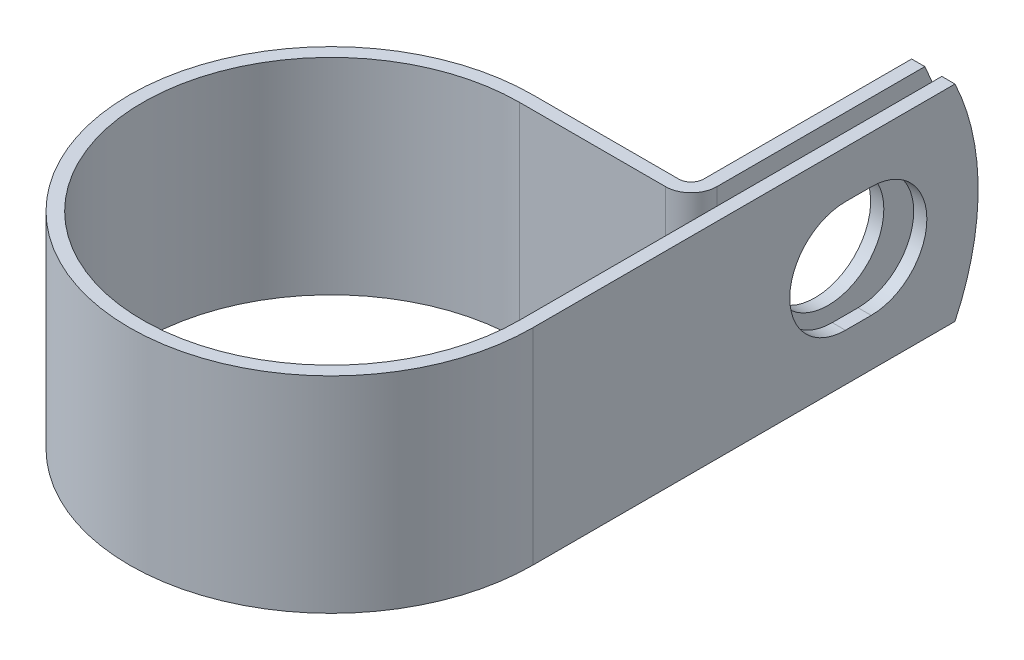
from build123d import *

# Parameters (mm, degrees)
EXTRUDE_THIN1_DEPTH = 9.525
SKETCH2_R           = 5.1562
CUT_EXTRUDE1_DEPTH  = 1.2192
CUT_EXTRUDE2_REACH  = 58.465
CUT_EXTRUDE3_DEPTH  = 54.893329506


with BuildPart() as part:
    # Sketch1 → Extrude-Thin1 (new, symmetric)
    with BuildSketch(Plane(origin=(0, 0, 0), x_dir=(1, 0, 0), z_dir=(0, 1, 0))):
        with BuildLine():
            Line((17.4625, 41.2496), (17.4625, 17.4625))
            Line((17.4625, 17.4625), (17.4625, 0))
            ThreePointArc((17.4625, 0), (-12.347852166, -12.347852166), (0, 17.4625))
            Line((0, 17.4625), (13.51026, 17.4625))
            ThreePointArc((13.51026, 17.4625), (15.191363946, 18.158836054), (15.8877, 19.83994))
            Line((15.8877, 19.83994), (15.8877, 41.2496))
            Line((15.8877, 41.2496), (14.6685, 41.2496))
            Line((14.6685, 41.2496), (14.6685, 19.83994))
            ThreePointArc((14.6685, 19.83994), (14.329259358, 19.020940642), (13.51026, 18.6817))
            Line((13.51026, 18.6817), (0, 18.6817))
            ThreePointArc((0, 18.6817), (-13.209956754, -13.209956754), (18.6817, 0))
            Line((18.6817, 0), (18.6817, 17.4625))
            Line((18.6817, 17.4625), (18.6817, 41.2496))
            Line((18.6817, 41.2496), (17.4625, 41.2496))
        make_face()
    extrude(amount=EXTRUDE_THIN1_DEPTH, both=True)

    # Sketch2 → Cut-Extrude1 (cut)
    with BuildSketch(Plane.ZY.offset(-14.6685)):
        with Locations((-30.1498, 0)):
            Circle(SKETCH2_R)
    extrude(amount=-CUT_EXTRUDE1_DEPTH, mode=Mode.SUBTRACT)

    # Sketch3 → Cut-Extrude2 (cut, up to next)
    with BuildSketch(Plane(origin=(18.6817, 0, 0), x_dir=(0, 0, -1), z_dir=(1, 0, 0)), mode=Mode.PRIVATE) as cut_extrude2_sk1:
        with BuildLine():
            Line((28.956, 5.1562), (31.3436, 5.1562))
            ThreePointArc((31.3436, 5.1562), (36.4998, 0), (31.3436, -5.1562))
            Line((31.3436, -5.1562), (28.956, -5.1562))
            ThreePointArc((28.956, -5.1562), (23.7998, 0), (28.956, 5.1562))
        make_face()
    cut_extrude2_tool1 = extrude(cut_extrude2_sk1.sketch, amount=-CUT_EXTRUDE2_REACH, mode=Mode.PRIVATE) & part.part
    add(cut_extrude2_tool1.solids().sort_by_distance((18.6817, 0, -30.1498))[0], mode=Mode.SUBTRACT)

    # Sketch4 → Cut-Extrude3 (cut, through all)
    with BuildSketch(Plane.ZY.offset(-14.6685)):
        with BuildLine():
            Line((-39.105063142, 9.525), (-41.2496, 9.525))
            Line((-41.2496, 9.525), (-41.2496, 0))
            ThreePointArc((-41.2496, 0), (-40.706838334, 4.881717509), (-39.105063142, 9.525))
        make_face()
        with BuildLine():
            ThreePointArc((-39.105063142, -9.525), (-40.706838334, -4.881717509), (-41.2496, 0))
            Line((-41.2496, 0), (-41.2496, -9.525))
            Line((-41.2496, -9.525), (-39.105063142, -9.525))
        make_face()
    extrude(amount=-CUT_EXTRUDE3_DEPTH, mode=Mode.SUBTRACT)


solid = part.part
